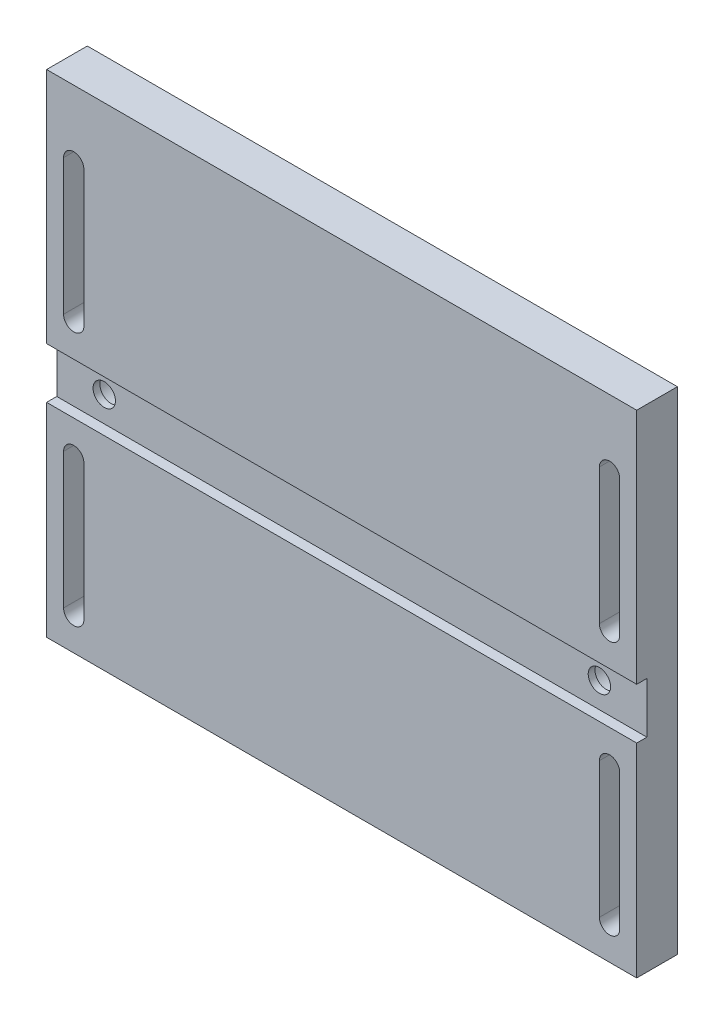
ISO-10303-21;
HEADER;
FILE_DESCRIPTION(('STEP AP214'),'2;1');
FILE_NAME('part.step','',(''),(''),'','','');
FILE_SCHEMA(('AUTOMOTIVE_DESIGN { 1 0 10303 214 1 1 1 1 }'));
ENDSEC;
DATA;
#1=APPLICATION_CONTEXT('core data for automotive mechanical design processes');
#2=APPLICATION_PROTOCOL_DEFINITION('international standard','automotive_design',2000,#1);
#3=PRODUCT_CONTEXT('',#1,'mechanical');
#4=PRODUCT('Part','Part','',(#3));
#5=PRODUCT_RELATED_PRODUCT_CATEGORY('part','',(#4));
#6=PRODUCT_DEFINITION_FORMATION('','',#4);
#7=PRODUCT_DEFINITION_CONTEXT('part definition',#1,'design');
#8=PRODUCT_DEFINITION('design','',#6,#7);
#9=PRODUCT_DEFINITION_SHAPE('','',#8);
#10=(LENGTH_UNIT() NAMED_UNIT(*) SI_UNIT(.MILLI.,.METRE.));
#11=(NAMED_UNIT(*) PLANE_ANGLE_UNIT() SI_UNIT($,.RADIAN.));
#12=(NAMED_UNIT(*) SI_UNIT($,.STERADIAN.) SOLID_ANGLE_UNIT());
#13=UNCERTAINTY_MEASURE_WITH_UNIT(LENGTH_MEASURE(1.E-05),#10,'distance_accuracy_value','');
#14=(GEOMETRIC_REPRESENTATION_CONTEXT(3) GLOBAL_UNCERTAINTY_ASSIGNED_CONTEXT((#13)) GLOBAL_UNIT_ASSIGNED_CONTEXT((#10,
#11,#12)) REPRESENTATION_CONTEXT('',''));
#15=CARTESIAN_POINT('',(0.,0.,0.));
#16=DIRECTION('',(0.,0.,1.));
#17=DIRECTION('',(1.,0.,0.));
#18=AXIS2_PLACEMENT_3D('',#15,#16,#17);
#19=CARTESIAN_POINT('',(-87.,-72.5,12.));
#20=DIRECTION('',(0.,0.,1.));
#21=DIRECTION('',(1.,0.,0.));
#22=AXIS2_PLACEMENT_3D('',#19,#20,#21);
#23=PLANE('',#22);
#24=CARTESIAN_POINT('',(79.,12.5,12.));
#25=DIRECTION('',(0.,0.,-1.));
#26=DIRECTION('',(1.,0.,0.));
#27=AXIS2_PLACEMENT_3D('',#24,#25,#26);
#28=CIRCLE('',#27,3.);
#29=CARTESIAN_POINT('',(82.,12.5,12.));
#30=VERTEX_POINT('',#29);
#31=CARTESIAN_POINT('',(76.,12.5,12.));
#32=VERTEX_POINT('',#31);
#33=EDGE_CURVE('E291',#30,#32,#28,.T.);
#34=ORIENTED_EDGE('',*,*,#33,.T.);
#35=DIRECTION('',(0.,1.,0.));
#36=VECTOR('',#35,1.);
#37=CARTESIAN_POINT('',(76.,52.5,12.));
#38=LINE('',#37,#36);
#39=CARTESIAN_POINT('',(76.,52.5,12.));
#40=VERTEX_POINT('',#39);
#41=EDGE_CURVE('E294',#32,#40,#38,.T.);
#42=ORIENTED_EDGE('',*,*,#41,.T.);
#43=CARTESIAN_POINT('',(79.,52.5,12.));
#44=DIRECTION('',(0.,0.,-1.));
#45=DIRECTION('',(1.,0.,0.));
#46=AXIS2_PLACEMENT_3D('',#43,#44,#45);
#47=CIRCLE('',#46,3.);
#48=CARTESIAN_POINT('',(82.,52.5,12.));
#49=VERTEX_POINT('',#48);
#50=EDGE_CURVE('E297',#40,#49,#47,.T.);
#51=ORIENTED_EDGE('',*,*,#50,.T.);
#52=DIRECTION('',(0.,-1.,0.));
#53=VECTOR('',#52,1.);
#54=CARTESIAN_POINT('',(82.,52.5,12.));
#55=LINE('',#54,#53);
#56=EDGE_CURVE('E300',#49,#30,#55,.T.);
#57=ORIENTED_EDGE('',*,*,#56,.T.);
#58=EDGE_LOOP('',(#34,#42,#51,#57));
#59=FACE_BOUND('',#58,.T.);
#60=CARTESIAN_POINT('',(-79.,52.5,12.));
#61=DIRECTION('',(0.,0.,-1.));
#62=DIRECTION('',(-1.,0.,0.));
#63=AXIS2_PLACEMENT_3D('',#60,#61,#62);
#64=CIRCLE('',#63,3.);
#65=CARTESIAN_POINT('',(-82.,52.5,12.));
#66=VERTEX_POINT('',#65);
#67=CARTESIAN_POINT('',(-76.,52.5,12.));
#68=VERTEX_POINT('',#67);
#69=EDGE_CURVE('E323',#66,#68,#64,.T.);
#70=ORIENTED_EDGE('',*,*,#69,.T.);
#71=DIRECTION('',(0.,-1.,0.));
#72=VECTOR('',#71,1.);
#73=CARTESIAN_POINT('',(-76.,52.5,12.));
#74=LINE('',#73,#72);
#75=CARTESIAN_POINT('',(-76.,12.5,12.));
#76=VERTEX_POINT('',#75);
#77=EDGE_CURVE('E326',#68,#76,#74,.T.);
#78=ORIENTED_EDGE('',*,*,#77,.T.);
#79=CARTESIAN_POINT('',(-79.,12.5,12.));
#80=DIRECTION('',(0.,0.,-1.));
#81=DIRECTION('',(-1.,0.,0.));
#82=AXIS2_PLACEMENT_3D('',#79,#80,#81);
#83=CIRCLE('',#82,3.);
#84=CARTESIAN_POINT('',(-82.,12.5,12.));
#85=VERTEX_POINT('',#84);
#86=EDGE_CURVE('E329',#76,#85,#83,.T.);
#87=ORIENTED_EDGE('',*,*,#86,.T.);
#88=DIRECTION('',(0.,1.,0.));
#89=VECTOR('',#88,1.);
#90=CARTESIAN_POINT('',(-82.,52.5,12.));
#91=LINE('',#90,#89);
#92=EDGE_CURVE('E332',#85,#66,#91,.T.);
#93=ORIENTED_EDGE('',*,*,#92,.T.);
#94=EDGE_LOOP('',(#70,#78,#87,#93));
#95=FACE_BOUND('',#94,.T.);
#96=DIRECTION('',(-1.,0.,0.));
#97=VECTOR('',#96,1.);
#98=CARTESIAN_POINT('',(-87.,2.49999999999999,12.));
#99=LINE('',#98,#97);
#100=CARTESIAN_POINT('',(87.,2.49999999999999,12.));
#101=VERTEX_POINT('',#100);
#102=CARTESIAN_POINT('',(-87.,2.49999999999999,12.));
#103=VERTEX_POINT('',#102);
#104=EDGE_CURVE('E365',#101,#103,#99,.T.);
#105=ORIENTED_EDGE('',*,*,#104,.F.);
#106=DIRECTION('',(0.,1.,0.));
#107=VECTOR('',#106,1.);
#108=CARTESIAN_POINT('',(87.,72.5,12.));
#109=LINE('',#108,#107);
#110=CARTESIAN_POINT('',(87.,72.5,12.));
#111=VERTEX_POINT('',#110);
#112=EDGE_CURVE('E403',#101,#111,#109,.T.);
#113=ORIENTED_EDGE('',*,*,#112,.T.);
#114=DIRECTION('',(-1.,0.,0.));
#115=VECTOR('',#114,1.);
#116=CARTESIAN_POINT('',(-87.,72.5,12.));
#117=LINE('',#116,#115);
#118=CARTESIAN_POINT('',(-87.,72.5,12.));
#119=VERTEX_POINT('',#118);
#120=EDGE_CURVE('E407',#111,#119,#117,.T.);
#121=ORIENTED_EDGE('',*,*,#120,.T.);
#122=DIRECTION('',(0.,-1.,0.));
#123=VECTOR('',#122,1.);
#124=CARTESIAN_POINT('',(-87.,72.5,12.));
#125=LINE('',#124,#123);
#126=EDGE_CURVE('E398',#119,#103,#125,.T.);
#127=ORIENTED_EDGE('',*,*,#126,.T.);
#128=EDGE_LOOP('',(#105,#113,#121,#127));
#129=FACE_BOUND('',#128,.T.);
#130=ADVANCED_FACE('F33',(#59,#95,#129),#23,.T.);
#131=CARTESIAN_POINT('',(-87.,72.5,12.));
#132=DIRECTION('',(1.,0.,0.));
#133=DIRECTION('',(0.,1.,0.));
#134=AXIS2_PLACEMENT_3D('',#131,#132,#133);
#135=PLANE('',#134);
#136=DIRECTION('',(0.,-1.,0.));
#137=VECTOR('',#136,1.);
#138=CARTESIAN_POINT('',(-87.,2.49999999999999,9.));
#139=LINE('',#138,#137);
#140=CARTESIAN_POINT('',(-87.,2.49999999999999,9.));
#141=VERTEX_POINT('',#140);
#142=CARTESIAN_POINT('',(-87.,-12.5,9.));
#143=VERTEX_POINT('',#142);
#144=EDGE_CURVE('E367',#141,#143,#139,.T.);
#145=ORIENTED_EDGE('',*,*,#144,.F.);
#146=DIRECTION('',(0.,0.,1.));
#147=VECTOR('',#146,1.);
#148=CARTESIAN_POINT('',(-87.,2.49999999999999,9.));
#149=LINE('',#148,#147);
#150=EDGE_CURVE('E379',#141,#103,#149,.T.);
#151=ORIENTED_EDGE('',*,*,#150,.T.);
#152=ORIENTED_EDGE('',*,*,#126,.F.);
#153=DIRECTION('',(0.,0.,-1.));
#154=VECTOR('',#153,1.);
#155=CARTESIAN_POINT('',(-87.,72.5,12.));
#156=LINE('',#155,#154);
#157=CARTESIAN_POINT('',(-87.,72.5,0.));
#158=VERTEX_POINT('',#157);
#159=EDGE_CURVE('E409',#119,#158,#156,.T.);
#160=ORIENTED_EDGE('',*,*,#159,.T.);
#161=DIRECTION('',(0.,-1.,0.));
#162=VECTOR('',#161,1.);
#163=CARTESIAN_POINT('',(-87.,72.5,0.));
#164=LINE('',#163,#162);
#165=CARTESIAN_POINT('',(-87.,-72.5,0.));
#166=VERTEX_POINT('',#165);
#167=EDGE_CURVE('E382',#158,#166,#164,.T.);
#168=ORIENTED_EDGE('',*,*,#167,.T.);
#169=DIRECTION('',(0.,0.,-1.));
#170=VECTOR('',#169,1.);
#171=CARTESIAN_POINT('',(-87.,-72.5,12.));
#172=LINE('',#171,#170);
#173=CARTESIAN_POINT('',(-87.,-72.5,12.));
#174=VERTEX_POINT('',#173);
#175=EDGE_CURVE('E11',#174,#166,#172,.T.);
#176=ORIENTED_EDGE('',*,*,#175,.F.);
#177=CARTESIAN_POINT('',(-87.,-12.5,12.));
#178=VERTEX_POINT('',#177);
#179=EDGE_CURVE('E397',#178,#174,#125,.T.);
#180=ORIENTED_EDGE('',*,*,#179,.F.);
#181=DIRECTION('',(0.,0.,1.));
#182=VECTOR('',#181,1.);
#183=CARTESIAN_POINT('',(-87.,-12.5,9.));
#184=LINE('',#183,#182);
#185=EDGE_CURVE('E378',#143,#178,#184,.T.);
#186=ORIENTED_EDGE('',*,*,#185,.F.);
#187=EDGE_LOOP('',(#145,#151,#152,#160,#168,#176,#180,#186));
#188=FACE_BOUND('',#187,.T.);
#189=ADVANCED_FACE('F35',(#188),#135,.F.);
#190=CARTESIAN_POINT('',(-87.,-72.5,12.));
#191=DIRECTION('',(0.,1.,0.));
#192=DIRECTION('',(0.,0.,1.));
#193=AXIS2_PLACEMENT_3D('',#190,#191,#192);
#194=PLANE('',#193);
#195=CARTESIAN_POINT('',(-17.5,-72.5,6.00000000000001));
#196=DIRECTION('',(0.,-1.,0.));
#197=DIRECTION('',(0.,0.,-1.));
#198=AXIS2_PLACEMENT_3D('',#195,#196,#197);
#199=CIRCLE('',#198,2.4);
#200=CARTESIAN_POINT('',(-17.5,-72.5,3.60000000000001));
#201=VERTEX_POINT('',#200);
#202=EDGE_CURVE('E209',#201,#201,#199,.T.);
#203=ORIENTED_EDGE('',*,*,#202,.F.);
#204=EDGE_LOOP('',(#203));
#205=FACE_BOUND('',#204,.T.);
#206=CARTESIAN_POINT('',(17.5,-72.5,6.00000000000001));
#207=DIRECTION('',(0.,-1.,0.));
#208=DIRECTION('',(0.,0.,-1.));
#209=AXIS2_PLACEMENT_3D('',#206,#207,#208);
#210=CIRCLE('',#209,2.4);
#211=CARTESIAN_POINT('',(17.5,-72.5,3.60000000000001));
#212=VERTEX_POINT('',#211);
#213=EDGE_CURVE('E217',#212,#212,#210,.T.);
#214=ORIENTED_EDGE('',*,*,#213,.F.);
#215=EDGE_LOOP('',(#214));
#216=FACE_BOUND('',#215,.T.);
#217=DIRECTION('',(1.,0.,0.));
#218=VECTOR('',#217,1.);
#219=CARTESIAN_POINT('',(-87.,-72.5,0.));
#220=LINE('',#219,#218);
#221=CARTESIAN_POINT('',(87.,-72.5,0.));
#222=VERTEX_POINT('',#221);
#223=EDGE_CURVE('E391',#166,#222,#220,.T.);
#224=ORIENTED_EDGE('',*,*,#223,.T.);
#225=DIRECTION('',(0.,0.,-1.));
#226=VECTOR('',#225,1.);
#227=CARTESIAN_POINT('',(87.,-72.5,12.));
#228=LINE('',#227,#226);
#229=CARTESIAN_POINT('',(87.,-72.5,12.));
#230=VERTEX_POINT('',#229);
#231=EDGE_CURVE('E42',#230,#222,#228,.T.);
#232=ORIENTED_EDGE('',*,*,#231,.F.);
#233=DIRECTION('',(1.,0.,0.));
#234=VECTOR('',#233,1.);
#235=CARTESIAN_POINT('',(-87.,-72.5,12.));
#236=LINE('',#235,#234);
#237=EDGE_CURVE('E401',#174,#230,#236,.T.);
#238=ORIENTED_EDGE('',*,*,#237,.F.);
#239=ORIENTED_EDGE('',*,*,#175,.T.);
#240=EDGE_LOOP('',(#224,#232,#238,#239));
#241=FACE_BOUND('',#240,.T.);
#242=ADVANCED_FACE('F463',(#205,#216,#241),#194,.F.);
#243=CARTESIAN_POINT('',(87.,72.5,12.));
#244=DIRECTION('',(-1.,0.,0.));
#245=DIRECTION('',(0.,-1.,0.));
#246=AXIS2_PLACEMENT_3D('',#243,#244,#245);
#247=PLANE('',#246);
#248=ORIENTED_EDGE('',*,*,#112,.F.);
#249=DIRECTION('',(0.,0.,1.));
#250=VECTOR('',#249,1.);
#251=CARTESIAN_POINT('',(87.,2.49999999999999,9.));
#252=LINE('',#251,#250);
#253=CARTESIAN_POINT('',(87.,2.49999999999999,9.));
#254=VERTEX_POINT('',#253);
#255=EDGE_CURVE('E383',#254,#101,#252,.T.);
#256=ORIENTED_EDGE('',*,*,#255,.F.);
#257=DIRECTION('',(0.,1.,0.));
#258=VECTOR('',#257,1.);
#259=CARTESIAN_POINT('',(87.,2.49999999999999,9.));
#260=LINE('',#259,#258);
#261=CARTESIAN_POINT('',(87.,-12.5,9.));
#262=VERTEX_POINT('',#261);
#263=EDGE_CURVE('E373',#262,#254,#260,.T.);
#264=ORIENTED_EDGE('',*,*,#263,.F.);
#265=DIRECTION('',(0.,0.,1.));
#266=VECTOR('',#265,1.);
#267=CARTESIAN_POINT('',(87.,-12.5,9.));
#268=LINE('',#267,#266);
#269=CARTESIAN_POINT('',(87.,-12.5,12.));
#270=VERTEX_POINT('',#269);
#271=EDGE_CURVE('E385',#262,#270,#268,.T.);
#272=ORIENTED_EDGE('',*,*,#271,.T.);
#273=EDGE_CURVE('E404',#230,#270,#109,.T.);
#274=ORIENTED_EDGE('',*,*,#273,.F.);
#275=ORIENTED_EDGE('',*,*,#231,.T.);
#276=DIRECTION('',(0.,1.,0.));
#277=VECTOR('',#276,1.);
#278=CARTESIAN_POINT('',(87.,72.5,0.));
#279=LINE('',#278,#277);
#280=CARTESIAN_POINT('',(87.,72.5,0.));
#281=VERTEX_POINT('',#280);
#282=EDGE_CURVE('E393',#222,#281,#279,.T.);
#283=ORIENTED_EDGE('',*,*,#282,.T.);
#284=DIRECTION('',(0.,0.,-1.));
#285=VECTOR('',#284,1.);
#286=CARTESIAN_POINT('',(87.,72.5,12.));
#287=LINE('',#286,#285);
#288=EDGE_CURVE('E412',#111,#281,#287,.T.);
#289=ORIENTED_EDGE('',*,*,#288,.F.);
#290=EDGE_LOOP('',(#248,#256,#264,#272,#274,#275,#283,#289));
#291=FACE_BOUND('',#290,.T.);
#292=ADVANCED_FACE('F445',(#291),#247,.F.);
#293=CARTESIAN_POINT('',(-87.,72.5,12.));
#294=DIRECTION('',(0.,-1.,0.));
#295=DIRECTION('',(0.,0.,-1.));
#296=AXIS2_PLACEMENT_3D('',#293,#294,#295);
#297=PLANE('',#296);
#298=DIRECTION('',(-1.,0.,0.));
#299=VECTOR('',#298,1.);
#300=CARTESIAN_POINT('',(-87.,72.5,0.));
#301=LINE('',#300,#299);
#302=EDGE_CURVE('E395',#281,#158,#301,.T.);
#303=ORIENTED_EDGE('',*,*,#302,.T.);
#304=ORIENTED_EDGE('',*,*,#159,.F.);
#305=ORIENTED_EDGE('',*,*,#120,.F.);
#306=ORIENTED_EDGE('',*,*,#288,.T.);
#307=EDGE_LOOP('',(#303,#304,#305,#306));
#308=FACE_BOUND('',#307,.T.);
#309=ADVANCED_FACE('F457',(#308),#297,.F.);
#310=CARTESIAN_POINT('',(-79.,-22.5,12.));
#311=DIRECTION('',(0.,0.,-1.));
#312=DIRECTION('',(1.,0.,0.));
#313=AXIS2_PLACEMENT_3D('',#310,#311,#312);
#314=CIRCLE('',#313,3.);
#315=CARTESIAN_POINT('',(-82.,-22.5,12.));
#316=VERTEX_POINT('',#315);
#317=CARTESIAN_POINT('',(-76.,-22.5,12.));
#318=VERTEX_POINT('',#317);
#319=EDGE_CURVE('E230',#316,#318,#314,.T.);
#320=ORIENTED_EDGE('',*,*,#319,.T.);
#321=DIRECTION('',(0.,-1.,0.));
#322=VECTOR('',#321,1.);
#323=CARTESIAN_POINT('',(-76.,-62.5,12.));
#324=LINE('',#323,#322);
#325=CARTESIAN_POINT('',(-76.,-62.5,12.));
#326=VERTEX_POINT('',#325);
#327=EDGE_CURVE('E233',#318,#326,#324,.T.);
#328=ORIENTED_EDGE('',*,*,#327,.T.);
#329=CARTESIAN_POINT('',(-79.,-62.5,12.));
#330=DIRECTION('',(0.,0.,-1.));
#331=DIRECTION('',(1.,0.,0.));
#332=AXIS2_PLACEMENT_3D('',#329,#330,#331);
#333=CIRCLE('',#332,3.);
#334=CARTESIAN_POINT('',(-82.,-62.5,12.));
#335=VERTEX_POINT('',#334);
#336=EDGE_CURVE('E50',#326,#335,#333,.T.);
#337=ORIENTED_EDGE('',*,*,#336,.T.);
#338=DIRECTION('',(0.,1.,0.));
#339=VECTOR('',#338,1.);
#340=CARTESIAN_POINT('',(-82.,-62.5,12.));
#341=LINE('',#340,#339);
#342=EDGE_CURVE('E237',#335,#316,#341,.T.);
#343=ORIENTED_EDGE('',*,*,#342,.T.);
#344=EDGE_LOOP('',(#320,#328,#337,#343));
#345=FACE_BOUND('',#344,.T.);
#346=CARTESIAN_POINT('',(79.,-62.5,12.));
#347=DIRECTION('',(0.,0.,-1.));
#348=DIRECTION('',(-1.,0.,0.));
#349=AXIS2_PLACEMENT_3D('',#346,#347,#348);
#350=CIRCLE('',#349,3.);
#351=CARTESIAN_POINT('',(82.,-62.5,12.));
#352=VERTEX_POINT('',#351);
#353=CARTESIAN_POINT('',(76.,-62.5,12.));
#354=VERTEX_POINT('',#353);
#355=EDGE_CURVE('E259',#352,#354,#350,.T.);
#356=ORIENTED_EDGE('',*,*,#355,.T.);
#357=DIRECTION('',(0.,1.,0.));
#358=VECTOR('',#357,1.);
#359=CARTESIAN_POINT('',(76.,-62.5,12.));
#360=LINE('',#359,#358);
#361=CARTESIAN_POINT('',(76.,-22.5,12.));
#362=VERTEX_POINT('',#361);
#363=EDGE_CURVE('E262',#354,#362,#360,.T.);
#364=ORIENTED_EDGE('',*,*,#363,.T.);
#365=CARTESIAN_POINT('',(79.,-22.5,12.));
#366=DIRECTION('',(0.,0.,-1.));
#367=DIRECTION('',(-1.,0.,0.));
#368=AXIS2_PLACEMENT_3D('',#365,#366,#367);
#369=CIRCLE('',#368,3.);
#370=CARTESIAN_POINT('',(82.,-22.5,12.));
#371=VERTEX_POINT('',#370);
#372=EDGE_CURVE('E265',#362,#371,#369,.T.);
#373=ORIENTED_EDGE('',*,*,#372,.T.);
#374=DIRECTION('',(0.,-1.,0.));
#375=VECTOR('',#374,1.);
#376=CARTESIAN_POINT('',(82.,-62.5,12.));
#377=LINE('',#376,#375);
#378=EDGE_CURVE('E268',#371,#352,#377,.T.);
#379=ORIENTED_EDGE('',*,*,#378,.T.);
#380=EDGE_LOOP('',(#356,#364,#373,#379));
#381=FACE_BOUND('',#380,.T.);
#382=DIRECTION('',(1.,0.,0.));
#383=VECTOR('',#382,1.);
#384=CARTESIAN_POINT('',(-87.,-12.5,12.));
#385=LINE('',#384,#383);
#386=EDGE_CURVE('E363',#178,#270,#385,.T.);
#387=ORIENTED_EDGE('',*,*,#386,.F.);
#388=ORIENTED_EDGE('',*,*,#179,.T.);
#389=ORIENTED_EDGE('',*,*,#237,.T.);
#390=ORIENTED_EDGE('',*,*,#273,.T.);
#391=EDGE_LOOP('',(#387,#388,#389,#390));
#392=FACE_BOUND('',#391,.T.);
#393=ADVANCED_FACE('F439',(#345,#381,#392),#23,.T.);
#394=CARTESIAN_POINT('',(-87.,-72.5,0.));
#395=DIRECTION('',(0.,0.,1.));
#396=DIRECTION('',(1.,0.,0.));
#397=AXIS2_PLACEMENT_3D('',#394,#395,#396);
#398=PLANE('',#397);
#399=DIRECTION('',(0.,-1.,0.));
#400=VECTOR('',#399,1.);
#401=CARTESIAN_POINT('',(-76.,-62.5,0.));
#402=LINE('',#401,#400);
#403=CARTESIAN_POINT('',(-76.,-22.5,0.));
#404=VERTEX_POINT('',#403);
#405=CARTESIAN_POINT('',(-76.,-62.5,0.));
#406=VERTEX_POINT('',#405);
#407=EDGE_CURVE('E221',#404,#406,#402,.T.);
#408=ORIENTED_EDGE('',*,*,#407,.F.);
#409=CARTESIAN_POINT('',(-79.,-22.5,0.));
#410=DIRECTION('',(0.,0.,-1.));
#411=DIRECTION('',(1.,0.,0.));
#412=AXIS2_PLACEMENT_3D('',#409,#410,#411);
#413=CIRCLE('',#412,3.);
#414=CARTESIAN_POINT('',(-82.,-22.5,0.));
#415=VERTEX_POINT('',#414);
#416=EDGE_CURVE('E58',#415,#404,#413,.T.);
#417=ORIENTED_EDGE('',*,*,#416,.F.);
#418=DIRECTION('',(0.,1.,0.));
#419=VECTOR('',#418,1.);
#420=CARTESIAN_POINT('',(-82.,-62.5,0.));
#421=LINE('',#420,#419);
#422=CARTESIAN_POINT('',(-82.,-62.5,0.));
#423=VERTEX_POINT('',#422);
#424=EDGE_CURVE('E227',#423,#415,#421,.T.);
#425=ORIENTED_EDGE('',*,*,#424,.F.);
#426=CARTESIAN_POINT('',(-79.,-62.5,0.));
#427=DIRECTION('',(0.,0.,-1.));
#428=DIRECTION('',(1.,0.,0.));
#429=AXIS2_PLACEMENT_3D('',#426,#427,#428);
#430=CIRCLE('',#429,3.);
#431=EDGE_CURVE('E224',#406,#423,#430,.T.);
#432=ORIENTED_EDGE('',*,*,#431,.F.);
#433=EDGE_LOOP('',(#408,#417,#425,#432));
#434=FACE_BOUND('',#433,.T.);
#435=DIRECTION('',(0.,1.,0.));
#436=VECTOR('',#435,1.);
#437=CARTESIAN_POINT('',(76.,-62.5,0.));
#438=LINE('',#437,#436);
#439=CARTESIAN_POINT('',(75.9999999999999,-62.5,0.));
#440=VERTEX_POINT('',#439);
#441=CARTESIAN_POINT('',(76.,-22.5,0.));
#442=VERTEX_POINT('',#441);
#443=EDGE_CURVE('E250',#440,#442,#438,.T.);
#444=ORIENTED_EDGE('',*,*,#443,.F.);
#445=CARTESIAN_POINT('',(79.,-62.5,0.));
#446=DIRECTION('',(0.,0.,-1.));
#447=DIRECTION('',(-1.,0.,0.));
#448=AXIS2_PLACEMENT_3D('',#445,#446,#447);
#449=CIRCLE('',#448,3.);
#450=CARTESIAN_POINT('',(82.,-62.5,0.));
#451=VERTEX_POINT('',#450);
#452=EDGE_CURVE('E243',#451,#440,#449,.T.);
#453=ORIENTED_EDGE('',*,*,#452,.F.);
#454=DIRECTION('',(0.,-1.,0.));
#455=VECTOR('',#454,1.);
#456=CARTESIAN_POINT('',(82.,-62.5,0.));
#457=LINE('',#456,#455);
#458=CARTESIAN_POINT('',(82.,-22.5,0.));
#459=VERTEX_POINT('',#458);
#460=EDGE_CURVE('E256',#459,#451,#457,.T.);
#461=ORIENTED_EDGE('',*,*,#460,.F.);
#462=CARTESIAN_POINT('',(79.,-22.5,0.));
#463=DIRECTION('',(0.,0.,-1.));
#464=DIRECTION('',(-1.,0.,0.));
#465=AXIS2_PLACEMENT_3D('',#462,#463,#464);
#466=CIRCLE('',#465,3.);
#467=EDGE_CURVE('E253',#442,#459,#466,.T.);
#468=ORIENTED_EDGE('',*,*,#467,.F.);
#469=EDGE_LOOP('',(#444,#453,#461,#468));
#470=FACE_BOUND('',#469,.T.);
#471=DIRECTION('',(0.,1.,0.));
#472=VECTOR('',#471,1.);
#473=CARTESIAN_POINT('',(76.,52.5,0.));
#474=LINE('',#473,#472);
#475=CARTESIAN_POINT('',(76.,12.5,0.));
#476=VERTEX_POINT('',#475);
#477=CARTESIAN_POINT('',(76.,52.5,0.));
#478=VERTEX_POINT('',#477);
#479=EDGE_CURVE('E282',#476,#478,#474,.T.);
#480=ORIENTED_EDGE('',*,*,#479,.F.);
#481=CARTESIAN_POINT('',(79.,12.5,0.));
#482=DIRECTION('',(0.,0.,-1.));
#483=DIRECTION('',(1.,0.,0.));
#484=AXIS2_PLACEMENT_3D('',#481,#482,#483);
#485=CIRCLE('',#484,3.);
#486=CARTESIAN_POINT('',(82.,12.5,0.));
#487=VERTEX_POINT('',#486);
#488=EDGE_CURVE('E274',#487,#476,#485,.T.);
#489=ORIENTED_EDGE('',*,*,#488,.F.);
#490=DIRECTION('',(0.,-1.,0.));
#491=VECTOR('',#490,1.);
#492=CARTESIAN_POINT('',(82.,52.5,0.));
#493=LINE('',#492,#491);
#494=CARTESIAN_POINT('',(82.,52.5,0.));
#495=VERTEX_POINT('',#494);
#496=EDGE_CURVE('E288',#495,#487,#493,.T.);
#497=ORIENTED_EDGE('',*,*,#496,.F.);
#498=CARTESIAN_POINT('',(79.,52.5,0.));
#499=DIRECTION('',(0.,0.,-1.));
#500=DIRECTION('',(1.,0.,0.));
#501=AXIS2_PLACEMENT_3D('',#498,#499,#500);
#502=CIRCLE('',#501,3.);
#503=EDGE_CURVE('E285',#478,#495,#502,.T.);
#504=ORIENTED_EDGE('',*,*,#503,.F.);
#505=EDGE_LOOP('',(#480,#489,#497,#504));
#506=FACE_BOUND('',#505,.T.);
#507=DIRECTION('',(0.,-1.,0.));
#508=VECTOR('',#507,1.);
#509=CARTESIAN_POINT('',(-76.,52.5,0.));
#510=LINE('',#509,#508);
#511=CARTESIAN_POINT('',(-76.,52.5,0.));
#512=VERTEX_POINT('',#511);
#513=CARTESIAN_POINT('',(-76.,12.5,0.));
#514=VERTEX_POINT('',#513);
#515=EDGE_CURVE('E314',#512,#514,#510,.T.);
#516=ORIENTED_EDGE('',*,*,#515,.F.);
#517=CARTESIAN_POINT('',(-79.,52.5,0.));
#518=DIRECTION('',(0.,0.,-1.));
#519=DIRECTION('',(-1.,0.,0.));
#520=AXIS2_PLACEMENT_3D('',#517,#518,#519);
#521=CIRCLE('',#520,3.);
#522=CARTESIAN_POINT('',(-82.,52.5,0.));
#523=VERTEX_POINT('',#522);
#524=EDGE_CURVE('E306',#523,#512,#521,.T.);
#525=ORIENTED_EDGE('',*,*,#524,.F.);
#526=DIRECTION('',(0.,1.,0.));
#527=VECTOR('',#526,1.);
#528=CARTESIAN_POINT('',(-82.,52.5,0.));
#529=LINE('',#528,#527);
#530=CARTESIAN_POINT('',(-82.,12.5,0.));
#531=VERTEX_POINT('',#530);
#532=EDGE_CURVE('E320',#531,#523,#529,.T.);
#533=ORIENTED_EDGE('',*,*,#532,.F.);
#534=CARTESIAN_POINT('',(-79.,12.5,0.));
#535=DIRECTION('',(0.,0.,-1.));
#536=DIRECTION('',(-1.,0.,0.));
#537=AXIS2_PLACEMENT_3D('',#534,#535,#536);
#538=CIRCLE('',#537,3.);
#539=EDGE_CURVE('E317',#514,#531,#538,.T.);
#540=ORIENTED_EDGE('',*,*,#539,.F.);
#541=EDGE_LOOP('',(#516,#525,#533,#540));
#542=FACE_BOUND('',#541,.T.);
#543=CARTESIAN_POINT('',(73.,-5.00000000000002,0.));
#544=DIRECTION('',(0.,0.,-1.));
#545=DIRECTION('',(-1.,0.,0.));
#546=AXIS2_PLACEMENT_3D('',#543,#544,#545);
#547=CIRCLE('',#546,5.50000000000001);
#548=CARTESIAN_POINT('',(67.5,-5.00000000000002,0.));
#549=VERTEX_POINT('',#548);
#550=EDGE_CURVE('E350',#549,#549,#547,.T.);
#551=ORIENTED_EDGE('',*,*,#550,.F.);
#552=EDGE_LOOP('',(#551));
#553=FACE_BOUND('',#552,.T.);
#554=CARTESIAN_POINT('',(-73.,-5.00000000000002,0.));
#555=DIRECTION('',(0.,0.,-1.));
#556=DIRECTION('',(-1.,0.,0.));
#557=AXIS2_PLACEMENT_3D('',#554,#555,#556);
#558=CIRCLE('',#557,5.50000000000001);
#559=CARTESIAN_POINT('',(-78.5,-5.00000000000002,0.));
#560=VERTEX_POINT('',#559);
#561=EDGE_CURVE('E359',#560,#560,#558,.T.);
#562=ORIENTED_EDGE('',*,*,#561,.F.);
#563=EDGE_LOOP('',(#562));
#564=FACE_BOUND('',#563,.T.);
#565=ORIENTED_EDGE('',*,*,#167,.F.);
#566=ORIENTED_EDGE('',*,*,#302,.F.);
#567=ORIENTED_EDGE('',*,*,#282,.F.);
#568=ORIENTED_EDGE('',*,*,#223,.F.);
#569=EDGE_LOOP('',(#565,#566,#567,#568));
#570=FACE_BOUND('',#569,.T.);
#571=ADVANCED_FACE('F461',(#434,#470,#506,#542,#553,#564,#570),#398,.F.);
#572=CARTESIAN_POINT('',(-87.,2.49999999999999,9.));
#573=DIRECTION('',(0.,1.,0.));
#574=DIRECTION('',(0.,0.,1.));
#575=AXIS2_PLACEMENT_3D('',#572,#573,#574);
#576=PLANE('',#575);
#577=ORIENTED_EDGE('',*,*,#104,.T.);
#578=ORIENTED_EDGE('',*,*,#150,.F.);
#579=DIRECTION('',(-1.,0.,0.));
#580=VECTOR('',#579,1.);
#581=CARTESIAN_POINT('',(-87.,2.49999999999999,9.));
#582=LINE('',#581,#580);
#583=EDGE_CURVE('E375',#254,#141,#582,.T.);
#584=ORIENTED_EDGE('',*,*,#583,.F.);
#585=ORIENTED_EDGE('',*,*,#255,.T.);
#586=EDGE_LOOP('',(#577,#578,#584,#585));
#587=FACE_BOUND('',#586,.T.);
#588=ADVANCED_FACE('F449',(#587),#576,.F.);
#589=CARTESIAN_POINT('',(-87.,-12.5,9.));
#590=DIRECTION('',(0.,-1.,0.));
#591=DIRECTION('',(0.,0.,-1.));
#592=AXIS2_PLACEMENT_3D('',#589,#590,#591);
#593=PLANE('',#592);
#594=ORIENTED_EDGE('',*,*,#386,.T.);
#595=ORIENTED_EDGE('',*,*,#271,.F.);
#596=DIRECTION('',(1.,0.,0.));
#597=VECTOR('',#596,1.);
#598=CARTESIAN_POINT('',(-87.,-12.5,9.));
#599=LINE('',#598,#597);
#600=EDGE_CURVE('E370',#143,#262,#599,.T.);
#601=ORIENTED_EDGE('',*,*,#600,.F.);
#602=ORIENTED_EDGE('',*,*,#185,.T.);
#603=EDGE_LOOP('',(#594,#595,#601,#602));
#604=FACE_BOUND('',#603,.T.);
#605=ADVANCED_FACE('F426',(#604),#593,.F.);
#606=CARTESIAN_POINT('',(-87.,-12.5,9.));
#607=DIRECTION('',(0.,0.,1.));
#608=DIRECTION('',(1.,0.,0.));
#609=AXIS2_PLACEMENT_3D('',#606,#607,#608);
#610=PLANE('',#609);
#611=CARTESIAN_POINT('',(73.,-5.00000000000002,9.));
#612=DIRECTION('',(0.,0.,1.));
#613=DIRECTION('',(1.,0.,0.));
#614=AXIS2_PLACEMENT_3D('',#611,#612,#613);
#615=CIRCLE('',#614,3.3);
#616=CARTESIAN_POINT('',(76.3,-5.00000000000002,9.));
#617=VERTEX_POINT('',#616);
#618=EDGE_CURVE('E37',#617,#617,#615,.T.);
#619=ORIENTED_EDGE('',*,*,#618,.F.);
#620=EDGE_LOOP('',(#619));
#621=FACE_BOUND('',#620,.T.);
#622=CARTESIAN_POINT('',(-73.,-5.00000000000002,9.));
#623=DIRECTION('',(0.,0.,1.));
#624=DIRECTION('',(1.,0.,0.));
#625=AXIS2_PLACEMENT_3D('',#622,#623,#624);
#626=CIRCLE('',#625,3.3);
#627=CARTESIAN_POINT('',(-69.7,-5.00000000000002,9.));
#628=VERTEX_POINT('',#627);
#629=EDGE_CURVE('E362',#628,#628,#626,.T.);
#630=ORIENTED_EDGE('',*,*,#629,.F.);
#631=EDGE_LOOP('',(#630));
#632=FACE_BOUND('',#631,.T.);
#633=ORIENTED_EDGE('',*,*,#144,.T.);
#634=ORIENTED_EDGE('',*,*,#600,.T.);
#635=ORIENTED_EDGE('',*,*,#263,.T.);
#636=ORIENTED_EDGE('',*,*,#583,.T.);
#637=EDGE_LOOP('',(#633,#634,#635,#636));
#638=FACE_BOUND('',#637,.T.);
#639=ADVANCED_FACE('F422',(#621,#632,#638),#610,.T.);
#640=CARTESIAN_POINT('',(-73.,-5.00000000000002,0.));
#641=DIRECTION('',(0.,0.,-1.));
#642=DIRECTION('',(-1.,0.,0.));
#643=AXIS2_PLACEMENT_3D('',#640,#641,#642);
#644=CYLINDRICAL_SURFACE('',#643,5.5);
#645=CARTESIAN_POINT('',(-73.,-5.00000000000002,7.));
#646=DIRECTION('',(0.,0.,-1.));
#647=DIRECTION('',(-1.,0.,0.));
#648=AXIS2_PLACEMENT_3D('',#645,#646,#647);
#649=CIRCLE('',#648,5.49999999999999);
#650=CARTESIAN_POINT('',(-78.5,-5.00000000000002,7.));
#651=VERTEX_POINT('',#650);
#652=EDGE_CURVE('E356',#651,#651,#649,.T.);
#653=ORIENTED_EDGE('',*,*,#652,.F.);
#654=EDGE_LOOP('',(#653));
#655=FACE_BOUND('',#654,.T.);
#656=ORIENTED_EDGE('',*,*,#561,.T.);
#657=EDGE_LOOP('',(#656));
#658=FACE_BOUND('',#657,.T.);
#659=ADVANCED_FACE('F425',(#655,#658),#644,.F.);
#660=CARTESIAN_POINT('',(-69.7,-5.00000000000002,7.));
#661=DIRECTION('',(0.,0.,1.));
#662=DIRECTION('',(1.,0.,0.));
#663=AXIS2_PLACEMENT_3D('',#660,#661,#662);
#664=PLANE('',#663);
#665=CARTESIAN_POINT('',(-73.,-5.00000000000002,7.));
#666=DIRECTION('',(0.,0.,-1.));
#667=DIRECTION('',(-1.,0.,0.));
#668=AXIS2_PLACEMENT_3D('',#665,#666,#667);
#669=CIRCLE('',#668,3.3);
#670=CARTESIAN_POINT('',(-76.3,-5.00000000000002,7.));
#671=VERTEX_POINT('',#670);
#672=EDGE_CURVE('E353',#671,#671,#669,.T.);
#673=ORIENTED_EDGE('',*,*,#672,.F.);
#674=EDGE_LOOP('',(#673));
#675=FACE_BOUND('',#674,.T.);
#676=ORIENTED_EDGE('',*,*,#652,.T.);
#677=EDGE_LOOP('',(#676));
#678=FACE_BOUND('',#677,.T.);
#679=ADVANCED_FACE('F521',(#675,#678),#664,.F.);
#680=CARTESIAN_POINT('',(-73.,-5.00000000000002,0.));
#681=DIRECTION('',(0.,0.,-1.));
#682=DIRECTION('',(-1.,0.,0.));
#683=AXIS2_PLACEMENT_3D('',#680,#681,#682);
#684=CYLINDRICAL_SURFACE('',#683,3.3);
#685=ORIENTED_EDGE('',*,*,#629,.T.);
#686=EDGE_LOOP('',(#685));
#687=FACE_BOUND('',#686,.T.);
#688=ORIENTED_EDGE('',*,*,#672,.T.);
#689=EDGE_LOOP('',(#688));
#690=FACE_BOUND('',#689,.T.);
#691=ADVANCED_FACE('F419',(#687,#690),#684,.F.);
#692=CARTESIAN_POINT('',(73.,-5.00000000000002,0.));
#693=DIRECTION('',(0.,0.,-1.));
#694=DIRECTION('',(-1.,0.,0.));
#695=AXIS2_PLACEMENT_3D('',#692,#693,#694);
#696=CYLINDRICAL_SURFACE('',#695,5.5);
#697=CARTESIAN_POINT('',(73.,-5.00000000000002,7.));
#698=DIRECTION('',(0.,0.,-1.));
#699=DIRECTION('',(-1.,0.,0.));
#700=AXIS2_PLACEMENT_3D('',#697,#698,#699);
#701=CIRCLE('',#700,5.49999999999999);
#702=CARTESIAN_POINT('',(67.5,-5.00000000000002,7.));
#703=VERTEX_POINT('',#702);
#704=EDGE_CURVE('E347',#703,#703,#701,.T.);
#705=ORIENTED_EDGE('',*,*,#704,.F.);
#706=EDGE_LOOP('',(#705));
#707=FACE_BOUND('',#706,.T.);
#708=ORIENTED_EDGE('',*,*,#550,.T.);
#709=EDGE_LOOP('',(#708));
#710=FACE_BOUND('',#709,.T.);
#711=ADVANCED_FACE('F562',(#707,#710),#696,.F.);
#712=CARTESIAN_POINT('',(76.3,-5.00000000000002,7.));
#713=DIRECTION('',(0.,0.,1.));
#714=DIRECTION('',(1.,0.,0.));
#715=AXIS2_PLACEMENT_3D('',#712,#713,#714);
#716=PLANE('',#715);
#717=CARTESIAN_POINT('',(73.,-5.00000000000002,7.));
#718=DIRECTION('',(0.,0.,-1.));
#719=DIRECTION('',(-1.,0.,0.));
#720=AXIS2_PLACEMENT_3D('',#717,#718,#719);
#721=CIRCLE('',#720,3.3);
#722=CARTESIAN_POINT('',(69.7,-5.00000000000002,7.));
#723=VERTEX_POINT('',#722);
#724=EDGE_CURVE('E338',#723,#723,#721,.T.);
#725=ORIENTED_EDGE('',*,*,#724,.F.);
#726=EDGE_LOOP('',(#725));
#727=FACE_BOUND('',#726,.T.);
#728=ORIENTED_EDGE('',*,*,#704,.T.);
#729=EDGE_LOOP('',(#728));
#730=FACE_BOUND('',#729,.T.);
#731=ADVANCED_FACE('F570',(#727,#730),#716,.F.);
#732=CARTESIAN_POINT('',(73.,-5.00000000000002,0.));
#733=DIRECTION('',(0.,0.,-1.));
#734=DIRECTION('',(-1.,0.,0.));
#735=AXIS2_PLACEMENT_3D('',#732,#733,#734);
#736=CYLINDRICAL_SURFACE('',#735,3.3);
#737=ORIENTED_EDGE('',*,*,#618,.T.);
#738=EDGE_LOOP('',(#737));
#739=FACE_BOUND('',#738,.T.);
#740=ORIENTED_EDGE('',*,*,#724,.T.);
#741=EDGE_LOOP('',(#740));
#742=FACE_BOUND('',#741,.T.);
#743=ADVANCED_FACE('F580',(#739,#742),#736,.F.);
#744=CARTESIAN_POINT('',(-79.,52.5,12.));
#745=DIRECTION('',(0.,0.,-1.));
#746=DIRECTION('',(-1.,0.,0.));
#747=AXIS2_PLACEMENT_3D('',#744,#745,#746);
#748=CYLINDRICAL_SURFACE('',#747,3.);
#749=ORIENTED_EDGE('',*,*,#524,.T.);
#750=DIRECTION('',(0.,0.,-1.));
#751=VECTOR('',#750,1.);
#752=CARTESIAN_POINT('',(-76.,52.5,12.));
#753=LINE('',#752,#751);
#754=EDGE_CURVE('E335',#68,#512,#753,.T.);
#755=ORIENTED_EDGE('',*,*,#754,.F.);
#756=ORIENTED_EDGE('',*,*,#69,.F.);
#757=DIRECTION('',(0.,0.,-1.));
#758=VECTOR('',#757,1.);
#759=CARTESIAN_POINT('',(-82.,52.5,12.));
#760=LINE('',#759,#758);
#761=EDGE_CURVE('E336',#66,#523,#760,.T.);
#762=ORIENTED_EDGE('',*,*,#761,.T.);
#763=EDGE_LOOP('',(#749,#755,#756,#762));
#764=FACE_BOUND('',#763,.T.);
#765=ADVANCED_FACE('F589',(#764),#748,.F.);
#766=CARTESIAN_POINT('',(-82.,52.5,12.));
#767=DIRECTION('',(-1.,0.,0.));
#768=DIRECTION('',(0.,0.,1.));
#769=AXIS2_PLACEMENT_3D('',#766,#767,#768);
#770=PLANE('',#769);
#771=ORIENTED_EDGE('',*,*,#532,.T.);
#772=ORIENTED_EDGE('',*,*,#761,.F.);
#773=ORIENTED_EDGE('',*,*,#92,.F.);
#774=DIRECTION('',(0.,0.,-1.));
#775=VECTOR('',#774,1.);
#776=CARTESIAN_POINT('',(-82.,12.5,12.));
#777=LINE('',#776,#775);
#778=EDGE_CURVE('E339',#85,#531,#777,.T.);
#779=ORIENTED_EDGE('',*,*,#778,.T.);
#780=EDGE_LOOP('',(#771,#772,#773,#779));
#781=FACE_BOUND('',#780,.T.);
#782=ADVANCED_FACE('F616',(#781),#770,.F.);
#783=CARTESIAN_POINT('',(-79.,12.5,12.));
#784=DIRECTION('',(0.,0.,-1.));
#785=DIRECTION('',(-1.,0.,0.));
#786=AXIS2_PLACEMENT_3D('',#783,#784,#785);
#787=CYLINDRICAL_SURFACE('',#786,3.);
#788=ORIENTED_EDGE('',*,*,#539,.T.);
#789=ORIENTED_EDGE('',*,*,#778,.F.);
#790=ORIENTED_EDGE('',*,*,#86,.F.);
#791=DIRECTION('',(0.,0.,-1.));
#792=VECTOR('',#791,1.);
#793=CARTESIAN_POINT('',(-76.,12.5,12.));
#794=LINE('',#793,#792);
#795=EDGE_CURVE('E341',#76,#514,#794,.T.);
#796=ORIENTED_EDGE('',*,*,#795,.T.);
#797=EDGE_LOOP('',(#788,#789,#790,#796));
#798=FACE_BOUND('',#797,.T.);
#799=ADVANCED_FACE('F626',(#798),#787,.F.);
#800=CARTESIAN_POINT('',(-76.,52.5,12.));
#801=DIRECTION('',(1.,0.,0.));
#802=DIRECTION('',(0.,1.,0.));
#803=AXIS2_PLACEMENT_3D('',#800,#801,#802);
#804=PLANE('',#803);
#805=ORIENTED_EDGE('',*,*,#515,.T.);
#806=ORIENTED_EDGE('',*,*,#795,.F.);
#807=ORIENTED_EDGE('',*,*,#77,.F.);
#808=ORIENTED_EDGE('',*,*,#754,.T.);
#809=EDGE_LOOP('',(#805,#806,#807,#808));
#810=FACE_BOUND('',#809,.T.);
#811=ADVANCED_FACE('F636',(#810),#804,.F.);
#812=CARTESIAN_POINT('',(79.,12.5,12.));
#813=DIRECTION('',(0.,0.,-1.));
#814=DIRECTION('',(-1.,0.,0.));
#815=AXIS2_PLACEMENT_3D('',#812,#813,#814);
#816=CYLINDRICAL_SURFACE('',#815,3.);
#817=ORIENTED_EDGE('',*,*,#488,.T.);
#818=DIRECTION('',(0.,0.,-1.));
#819=VECTOR('',#818,1.);
#820=CARTESIAN_POINT('',(76.,12.5,12.));
#821=LINE('',#820,#819);
#822=EDGE_CURVE('E303',#32,#476,#821,.T.);
#823=ORIENTED_EDGE('',*,*,#822,.F.);
#824=ORIENTED_EDGE('',*,*,#33,.F.);
#825=DIRECTION('',(0.,0.,-1.));
#826=VECTOR('',#825,1.);
#827=CARTESIAN_POINT('',(82.,12.5,12.));
#828=LINE('',#827,#826);
#829=EDGE_CURVE('E304',#30,#487,#828,.T.);
#830=ORIENTED_EDGE('',*,*,#829,.T.);
#831=EDGE_LOOP('',(#817,#823,#824,#830));
#832=FACE_BOUND('',#831,.T.);
#833=ADVANCED_FACE('F646',(#832),#816,.F.);
#834=CARTESIAN_POINT('',(82.,52.5,12.));
#835=DIRECTION('',(1.,0.,0.));
#836=DIRECTION('',(0.,0.,-1.));
#837=AXIS2_PLACEMENT_3D('',#834,#835,#836);
#838=PLANE('',#837);
#839=ORIENTED_EDGE('',*,*,#496,.T.);
#840=ORIENTED_EDGE('',*,*,#829,.F.);
#841=ORIENTED_EDGE('',*,*,#56,.F.);
#842=DIRECTION('',(0.,0.,-1.));
#843=VECTOR('',#842,1.);
#844=CARTESIAN_POINT('',(82.,52.5,12.));
#845=LINE('',#844,#843);
#846=EDGE_CURVE('E307',#49,#495,#845,.T.);
#847=ORIENTED_EDGE('',*,*,#846,.T.);
#848=EDGE_LOOP('',(#839,#840,#841,#847));
#849=FACE_BOUND('',#848,.T.);
#850=ADVANCED_FACE('F656',(#849),#838,.F.);
#851=CARTESIAN_POINT('',(79.,52.5,12.));
#852=DIRECTION('',(0.,0.,-1.));
#853=DIRECTION('',(-1.,0.,0.));
#854=AXIS2_PLACEMENT_3D('',#851,#852,#853);
#855=CYLINDRICAL_SURFACE('',#854,3.);
#856=ORIENTED_EDGE('',*,*,#503,.T.);
#857=ORIENTED_EDGE('',*,*,#846,.F.);
#858=ORIENTED_EDGE('',*,*,#50,.F.);
#859=DIRECTION('',(0.,0.,-1.));
#860=VECTOR('',#859,1.);
#861=CARTESIAN_POINT('',(76.,52.5,12.));
#862=LINE('',#861,#860);
#863=EDGE_CURVE('E309',#40,#478,#862,.T.);
#864=ORIENTED_EDGE('',*,*,#863,.T.);
#865=EDGE_LOOP('',(#856,#857,#858,#864));
#866=FACE_BOUND('',#865,.T.);
#867=ADVANCED_FACE('F666',(#866),#855,.F.);
#868=CARTESIAN_POINT('',(76.,52.5,12.));
#869=DIRECTION('',(-1.,0.,0.));
#870=DIRECTION('',(0.,-1.,0.));
#871=AXIS2_PLACEMENT_3D('',#868,#869,#870);
#872=PLANE('',#871);
#873=ORIENTED_EDGE('',*,*,#479,.T.);
#874=ORIENTED_EDGE('',*,*,#863,.F.);
#875=ORIENTED_EDGE('',*,*,#41,.F.);
#876=ORIENTED_EDGE('',*,*,#822,.T.);
#877=EDGE_LOOP('',(#873,#874,#875,#876));
#878=FACE_BOUND('',#877,.T.);
#879=ADVANCED_FACE('F676',(#878),#872,.F.);
#880=CARTESIAN_POINT('',(79.,-62.5,12.));
#881=DIRECTION('',(0.,0.,-1.));
#882=DIRECTION('',(-1.,0.,0.));
#883=AXIS2_PLACEMENT_3D('',#880,#881,#882);
#884=CYLINDRICAL_SURFACE('',#883,3.);
#885=ORIENTED_EDGE('',*,*,#452,.T.);
#886=DIRECTION('',(0.,0.,-1.));
#887=VECTOR('',#886,1.);
#888=CARTESIAN_POINT('',(76.,-62.5,12.));
#889=LINE('',#888,#887);
#890=EDGE_CURVE('E271',#354,#440,#889,.T.);
#891=ORIENTED_EDGE('',*,*,#890,.F.);
#892=ORIENTED_EDGE('',*,*,#355,.F.);
#893=DIRECTION('',(0.,0.,-1.));
#894=VECTOR('',#893,1.);
#895=CARTESIAN_POINT('',(82.,-62.5,12.));
#896=LINE('',#895,#894);
#897=EDGE_CURVE('E272',#352,#451,#896,.T.);
#898=ORIENTED_EDGE('',*,*,#897,.T.);
#899=EDGE_LOOP('',(#885,#891,#892,#898));
#900=FACE_BOUND('',#899,.T.);
#901=ADVANCED_FACE('F494',(#900),#884,.F.);
#902=CARTESIAN_POINT('',(82.,-62.5,12.));
#903=DIRECTION('',(1.,0.,0.));
#904=DIRECTION('',(0.,0.,-1.));
#905=AXIS2_PLACEMENT_3D('',#902,#903,#904);
#906=PLANE('',#905);
#907=ORIENTED_EDGE('',*,*,#460,.T.);
#908=ORIENTED_EDGE('',*,*,#897,.F.);
#909=ORIENTED_EDGE('',*,*,#378,.F.);
#910=DIRECTION('',(0.,0.,-1.));
#911=VECTOR('',#910,1.);
#912=CARTESIAN_POINT('',(82.,-22.5,12.));
#913=LINE('',#912,#911);
#914=EDGE_CURVE('E275',#371,#459,#913,.T.);
#915=ORIENTED_EDGE('',*,*,#914,.T.);
#916=EDGE_LOOP('',(#907,#908,#909,#915));
#917=FACE_BOUND('',#916,.T.);
#918=ADVANCED_FACE('F505',(#917),#906,.F.);
#919=CARTESIAN_POINT('',(79.,-22.5,12.));
#920=DIRECTION('',(0.,0.,-1.));
#921=DIRECTION('',(-1.,0.,0.));
#922=AXIS2_PLACEMENT_3D('',#919,#920,#921);
#923=CYLINDRICAL_SURFACE('',#922,3.);
#924=ORIENTED_EDGE('',*,*,#467,.T.);
#925=ORIENTED_EDGE('',*,*,#914,.F.);
#926=ORIENTED_EDGE('',*,*,#372,.F.);
#927=DIRECTION('',(0.,0.,-1.));
#928=VECTOR('',#927,1.);
#929=CARTESIAN_POINT('',(76.,-22.5,12.));
#930=LINE('',#929,#928);
#931=EDGE_CURVE('E277',#362,#442,#930,.T.);
#932=ORIENTED_EDGE('',*,*,#931,.T.);
#933=EDGE_LOOP('',(#924,#925,#926,#932));
#934=FACE_BOUND('',#933,.T.);
#935=ADVANCED_FACE('F502',(#934),#923,.F.);
#936=CARTESIAN_POINT('',(76.,-62.5,12.));
#937=DIRECTION('',(-1.,0.,0.));
#938=DIRECTION('',(0.,-1.,0.));
#939=AXIS2_PLACEMENT_3D('',#936,#937,#938);
#940=PLANE('',#939);
#941=ORIENTED_EDGE('',*,*,#443,.T.);
#942=ORIENTED_EDGE('',*,*,#931,.F.);
#943=ORIENTED_EDGE('',*,*,#363,.F.);
#944=ORIENTED_EDGE('',*,*,#890,.T.);
#945=EDGE_LOOP('',(#941,#942,#943,#944));
#946=FACE_BOUND('',#945,.T.);
#947=ADVANCED_FACE('F499',(#946),#940,.F.);
#948=CARTESIAN_POINT('',(-79.,-22.5,12.));
#949=DIRECTION('',(0.,0.,-1.));
#950=DIRECTION('',(-1.,0.,0.));
#951=AXIS2_PLACEMENT_3D('',#948,#949,#950);
#952=CYLINDRICAL_SURFACE('',#951,3.);
#953=ORIENTED_EDGE('',*,*,#416,.T.);
#954=DIRECTION('',(0.,0.,-1.));
#955=VECTOR('',#954,1.);
#956=CARTESIAN_POINT('',(-76.,-22.5,12.));
#957=LINE('',#956,#955);
#958=EDGE_CURVE('E240',#318,#404,#957,.T.);
#959=ORIENTED_EDGE('',*,*,#958,.F.);
#960=ORIENTED_EDGE('',*,*,#319,.F.);
#961=DIRECTION('',(0.,0.,-1.));
#962=VECTOR('',#961,1.);
#963=CARTESIAN_POINT('',(-82.,-22.5,12.));
#964=LINE('',#963,#962);
#965=EDGE_CURVE('E241',#316,#415,#964,.T.);
#966=ORIENTED_EDGE('',*,*,#965,.T.);
#967=EDGE_LOOP('',(#953,#959,#960,#966));
#968=FACE_BOUND('',#967,.T.);
#969=ADVANCED_FACE('F719',(#968),#952,.F.);
#970=CARTESIAN_POINT('',(-82.,-62.5,12.));
#971=DIRECTION('',(-1.,0.,0.));
#972=DIRECTION('',(0.,0.,1.));
#973=AXIS2_PLACEMENT_3D('',#970,#971,#972);
#974=PLANE('',#973);
#975=ORIENTED_EDGE('',*,*,#424,.T.);
#976=ORIENTED_EDGE('',*,*,#965,.F.);
#977=ORIENTED_EDGE('',*,*,#342,.F.);
#978=DIRECTION('',(0.,0.,-1.));
#979=VECTOR('',#978,1.);
#980=CARTESIAN_POINT('',(-82.,-62.5,12.));
#981=LINE('',#980,#979);
#982=EDGE_CURVE('E244',#335,#423,#981,.T.);
#983=ORIENTED_EDGE('',*,*,#982,.T.);
#984=EDGE_LOOP('',(#975,#976,#977,#983));
#985=FACE_BOUND('',#984,.T.);
#986=ADVANCED_FACE('F728',(#985),#974,.F.);
#987=CARTESIAN_POINT('',(-79.,-62.5,12.));
#988=DIRECTION('',(0.,0.,-1.));
#989=DIRECTION('',(-1.,0.,0.));
#990=AXIS2_PLACEMENT_3D('',#987,#988,#989);
#991=CYLINDRICAL_SURFACE('',#990,3.);
#992=ORIENTED_EDGE('',*,*,#431,.T.);
#993=ORIENTED_EDGE('',*,*,#982,.F.);
#994=ORIENTED_EDGE('',*,*,#336,.F.);
#995=DIRECTION('',(0.,0.,-1.));
#996=VECTOR('',#995,1.);
#997=CARTESIAN_POINT('',(-76.,-62.5,12.));
#998=LINE('',#997,#996);
#999=EDGE_CURVE('E246',#326,#406,#998,.T.);
#1000=ORIENTED_EDGE('',*,*,#999,.T.);
#1001=EDGE_LOOP('',(#992,#993,#994,#1000));
#1002=FACE_BOUND('',#1001,.T.);
#1003=ADVANCED_FACE('F737',(#1002),#991,.F.);
#1004=CARTESIAN_POINT('',(-76.,-62.5,12.));
#1005=DIRECTION('',(1.,0.,0.));
#1006=DIRECTION('',(0.,1.,0.));
#1007=AXIS2_PLACEMENT_3D('',#1004,#1005,#1006);
#1008=PLANE('',#1007);
#1009=ORIENTED_EDGE('',*,*,#407,.T.);
#1010=ORIENTED_EDGE('',*,*,#999,.F.);
#1011=ORIENTED_EDGE('',*,*,#327,.F.);
#1012=ORIENTED_EDGE('',*,*,#958,.T.);
#1013=EDGE_LOOP('',(#1009,#1010,#1011,#1012));
#1014=FACE_BOUND('',#1013,.T.);
#1015=ADVANCED_FACE('F747',(#1014),#1008,.F.);
#1016=CARTESIAN_POINT('',(17.5,-72.5,6.00000000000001));
#1017=DIRECTION('',(0.,-1.,0.));
#1018=DIRECTION('',(0.,0.,-1.));
#1019=AXIS2_PLACEMENT_3D('',#1016,#1017,#1018);
#1020=CYLINDRICAL_SURFACE('',#1019,2.4);
#1021=CARTESIAN_POINT('',(17.5,-42.5,6.00000000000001));
#1022=DIRECTION('',(0.,-1.,0.));
#1023=DIRECTION('',(0.,0.,-1.));
#1024=AXIS2_PLACEMENT_3D('',#1021,#1022,#1023);
#1025=CIRCLE('',#1024,2.39999999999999);
#1026=CARTESIAN_POINT('',(17.5,-42.5,3.60000000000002));
#1027=VERTEX_POINT('',#1026);
#1028=EDGE_CURVE('E212',#1027,#1027,#1025,.T.);
#1029=ORIENTED_EDGE('',*,*,#1028,.F.);
#1030=EDGE_LOOP('',(#1029));
#1031=FACE_BOUND('',#1030,.T.);
#1032=ORIENTED_EDGE('',*,*,#213,.T.);
#1033=EDGE_LOOP('',(#1032));
#1034=FACE_BOUND('',#1033,.T.);
#1035=ADVANCED_FACE('F755',(#1031,#1034),#1020,.F.);
#1036=CARTESIAN_POINT('',(17.5,-42.5,6.00000000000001));
#1037=DIRECTION('',(0.,-1.,0.));
#1038=DIRECTION('',(0.,0.,-1.));
#1039=AXIS2_PLACEMENT_3D('',#1036,#1037,#1038);
#1040=CONICAL_SURFACE('',#1039,2.39999999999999,1.02974425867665);
#1041=CARTESIAN_POINT('',(17.5,-41.0579345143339,6.00000000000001));
#1042=VERTEX_POINT('',#1041);
#1043=VERTEX_LOOP('',#1042);
#1044=FACE_BOUND('',#1043,.T.);
#1045=ORIENTED_EDGE('',*,*,#1028,.T.);
#1046=EDGE_LOOP('',(#1045));
#1047=FACE_BOUND('',#1046,.T.);
#1048=ADVANCED_FACE('F773',(#1044,#1047),#1040,.F.);
#1049=CARTESIAN_POINT('',(-17.5,-72.5,6.00000000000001));
#1050=DIRECTION('',(0.,-1.,0.));
#1051=DIRECTION('',(0.,0.,-1.));
#1052=AXIS2_PLACEMENT_3D('',#1049,#1050,#1051);
#1053=CYLINDRICAL_SURFACE('',#1052,2.4);
#1054=CARTESIAN_POINT('',(-17.5,-42.5,6.00000000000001));
#1055=DIRECTION('',(0.,-1.,0.));
#1056=DIRECTION('',(0.,0.,-1.));
#1057=AXIS2_PLACEMENT_3D('',#1054,#1055,#1056);
#1058=CIRCLE('',#1057,2.39999999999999);
#1059=CARTESIAN_POINT('',(-17.5,-42.5,3.60000000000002));
#1060=VERTEX_POINT('',#1059);
#1061=EDGE_CURVE('E207',#1060,#1060,#1058,.T.);
#1062=ORIENTED_EDGE('',*,*,#1061,.F.);
#1063=EDGE_LOOP('',(#1062));
#1064=FACE_BOUND('',#1063,.T.);
#1065=ORIENTED_EDGE('',*,*,#202,.T.);
#1066=EDGE_LOOP('',(#1065));
#1067=FACE_BOUND('',#1066,.T.);
#1068=ADVANCED_FACE('F203',(#1064,#1067),#1053,.F.);
#1069=CARTESIAN_POINT('',(-17.5,-42.5,6.00000000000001));
#1070=DIRECTION('',(0.,-1.,0.));
#1071=DIRECTION('',(0.,0.,-1.));
#1072=AXIS2_PLACEMENT_3D('',#1069,#1070,#1071);
#1073=CONICAL_SURFACE('',#1072,2.39999999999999,1.02974425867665);
#1074=CARTESIAN_POINT('',(-17.5,-41.0579345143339,6.00000000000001));
#1075=VERTEX_POINT('',#1074);
#1076=VERTEX_LOOP('',#1075);
#1077=FACE_BOUND('',#1076,.T.);
#1078=ORIENTED_EDGE('',*,*,#1061,.T.);
#1079=EDGE_LOOP('',(#1078));
#1080=FACE_BOUND('',#1079,.T.);
#1081=ADVANCED_FACE('F200',(#1077,#1080),#1073,.F.);
#1082=CLOSED_SHELL('',(#130,#189,#242,#292,#309,#393,#571,#588,#605,#639,#659,#679,#691,#711,
#731,#743,#765,#782,#799,#811,#833,#850,#867,#879,#901,#918,#935,#947,#969,#986,#1003,#1015,
#1035,#1048,#1068,#1081));
#1083=MANIFOLD_SOLID_BREP('B2',#1082);
#1084=ADVANCED_BREP_SHAPE_REPRESENTATION('',(#18,#1083),#14);
#1085=SHAPE_DEFINITION_REPRESENTATION(#9,#1084);
ENDSEC;
END-ISO-10303-21;
